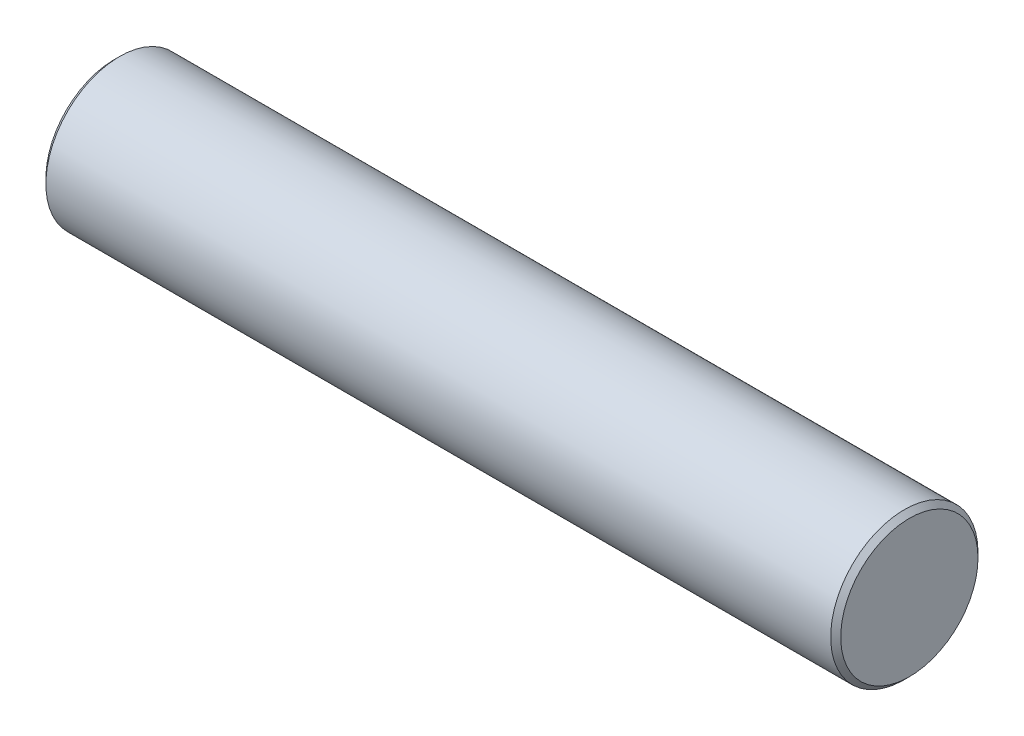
from build123d import *


with BuildPart() as part:
    # Sketch1 → Base-Revolve (revolve)
    with BuildSketch(Plane.XY, mode=Mode.PRIVATE) as base_revolve_sk:
        Polygon((72, 91.946424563), (23.440489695, 91.946424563), (23.440489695, 96.139547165), (23.747367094, 96.446424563), (71.693122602, 96.446424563), (72, 96.139547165), align=None)
    revolve(base_revolve_sk.sketch.rotate(Axis((72.032735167, 91.946424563, 0), (-1, 0, 0)), 90), axis=Axis((72.032735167, 91.946424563, 0), (-1, 0, 0)))


solid = part.part
